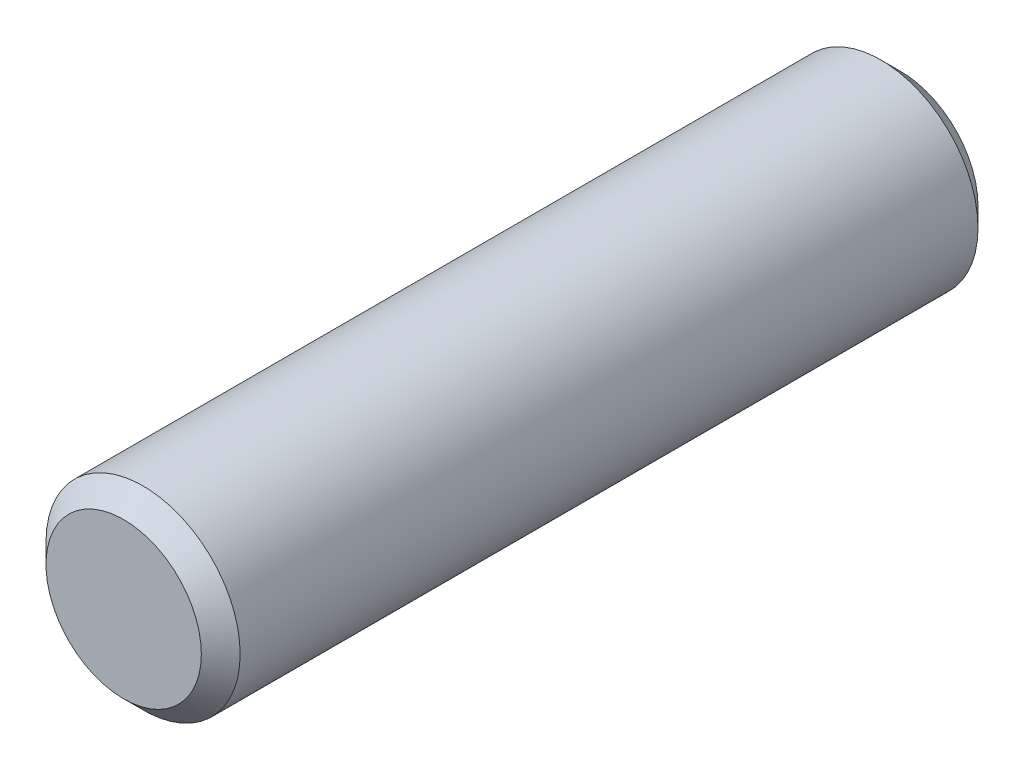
from build123d import *

# Parameters (mm, degrees)
SKETCH1_R           = 3.175
BOSS_EXTRUDE1_DEPTH = 25.4
CHAMFER1_SIZE       = 0.635


with BuildPart() as part:
    # Sketch1 → Boss-Extrude1 (new body)
    with BuildSketch(Plane.XY):
        Circle(SKETCH1_R)
    extrude(amount=BOSS_EXTRUDE1_DEPTH)

    # Chamfer1
    chamfer1_edges = [part.edges().sort_by_distance(p)[0] for p in [
        (-3.175, 0, 0),
        (-3.175, 0, 25.4),
    ]]
    chamfer(chamfer1_edges, length=CHAMFER1_SIZE)


solid = part.part
